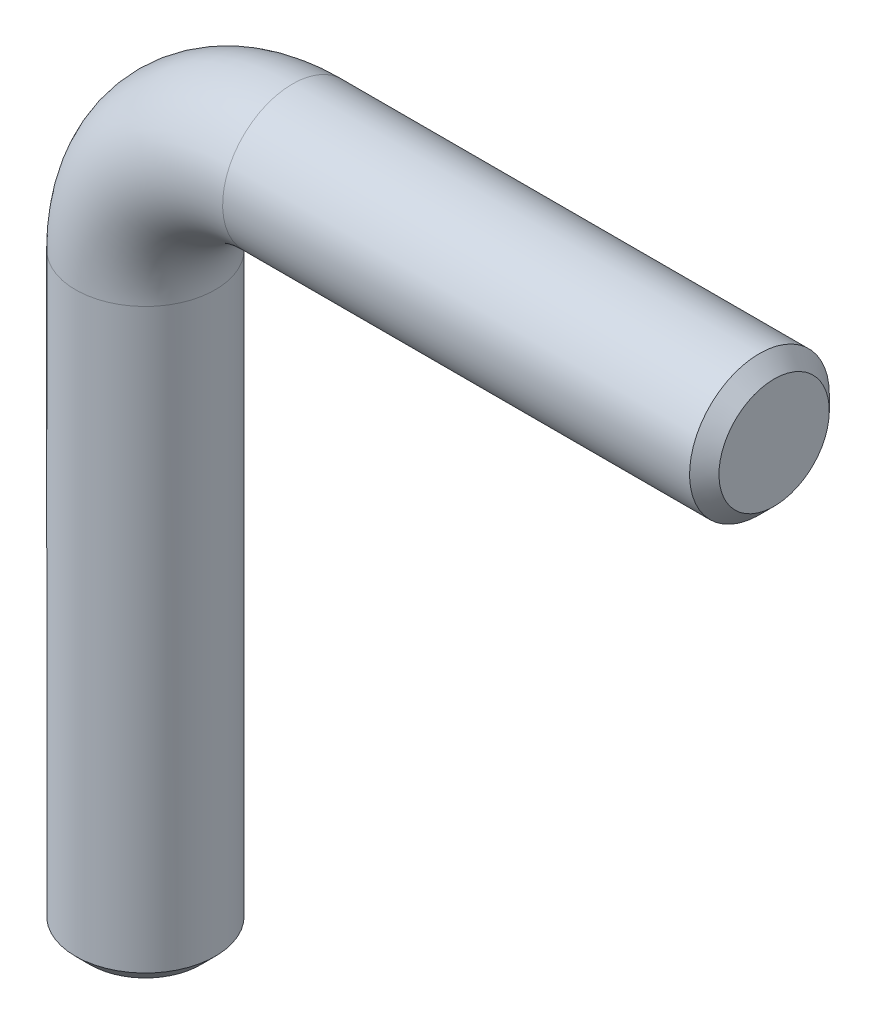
ISO-10303-21;
HEADER;
FILE_DESCRIPTION(('STEP AP214'),'2;1');
FILE_NAME('part.step','',(''),(''),'','','');
FILE_SCHEMA(('AUTOMOTIVE_DESIGN { 1 0 10303 214 1 1 1 1 }'));
ENDSEC;
DATA;
#1=APPLICATION_CONTEXT('core data for automotive mechanical design processes');
#2=APPLICATION_PROTOCOL_DEFINITION('international standard','automotive_design',2000,#1);
#3=PRODUCT_CONTEXT('',#1,'mechanical');
#4=PRODUCT('Part','Part','',(#3));
#5=PRODUCT_RELATED_PRODUCT_CATEGORY('part','',(#4));
#6=PRODUCT_DEFINITION_FORMATION('','',#4);
#7=PRODUCT_DEFINITION_CONTEXT('part definition',#1,'design');
#8=PRODUCT_DEFINITION('design','',#6,#7);
#9=PRODUCT_DEFINITION_SHAPE('','',#8);
#10=(LENGTH_UNIT() NAMED_UNIT(*) SI_UNIT(.MILLI.,.METRE.));
#11=(NAMED_UNIT(*) PLANE_ANGLE_UNIT() SI_UNIT($,.RADIAN.));
#12=(NAMED_UNIT(*) SI_UNIT($,.STERADIAN.) SOLID_ANGLE_UNIT());
#13=UNCERTAINTY_MEASURE_WITH_UNIT(LENGTH_MEASURE(1.E-05),#10,'distance_accuracy_value','');
#14=(GEOMETRIC_REPRESENTATION_CONTEXT(3) GLOBAL_UNCERTAINTY_ASSIGNED_CONTEXT((#13)) GLOBAL_UNIT_ASSIGNED_CONTEXT((#10,
#11,#12)) REPRESENTATION_CONTEXT('',''));
#15=CARTESIAN_POINT('',(0.,0.,0.));
#16=DIRECTION('',(0.,0.,1.));
#17=DIRECTION('',(1.,0.,0.));
#18=AXIS2_PLACEMENT_3D('',#15,#16,#17);
#19=CARTESIAN_POINT('',(10.,50.25,0.));
#20=DIRECTION('',(1.,0.,0.));
#21=DIRECTION('',(0.,0.,-1.));
#22=AXIS2_PLACEMENT_3D('',#19,#20,#21);
#23=CYLINDRICAL_SURFACE('',#22,4.75);
#24=CARTESIAN_POINT('',(41.75,50.25,0.));
#25=DIRECTION('',(1.,0.,0.));
#26=DIRECTION('',(0.,0.,-1.));
#27=AXIS2_PLACEMENT_3D('',#24,#25,#26);
#28=CIRCLE('',#27,4.75);
#29=CARTESIAN_POINT('',(41.75,50.25,-4.75));
#30=VERTEX_POINT('',#29);
#31=EDGE_CURVE('E10',#30,#30,#28,.F.);
#32=ORIENTED_EDGE('',*,*,#31,.T.);
#33=EDGE_LOOP('',(#32));
#34=FACE_BOUND('',#33,.T.);
#35=CARTESIAN_POINT('',(10.,50.25,0.));
#36=DIRECTION('',(1.,0.,0.));
#37=DIRECTION('',(0.,0.,1.));
#38=AXIS2_PLACEMENT_3D('',#35,#36,#37);
#39=CIRCLE('',#38,4.75);
#40=CARTESIAN_POINT('',(10.,55.,0.));
#41=VERTEX_POINT('',#40);
#42=EDGE_CURVE('E53',#41,#41,#39,.T.);
#43=ORIENTED_EDGE('',*,*,#42,.T.);
#44=EDGE_LOOP('',(#43));
#45=FACE_BOUND('',#44,.T.);
#46=ADVANCED_FACE('F33',(#34,#45),#23,.T.);
#47=CARTESIAN_POINT('',(10.,40.25,0.));
#48=DIRECTION('',(0.,0.,-1.));
#49=DIRECTION('',(-1.,0.,0.));
#50=AXIS2_PLACEMENT_3D('',#47,#48,#49);
#51=TOROIDAL_SURFACE('',#50,10.,4.75);
#52=CARTESIAN_POINT('',(0.,40.25,0.));
#53=DIRECTION('',(0.,1.,0.));
#54=DIRECTION('',(0.,0.,1.));
#55=AXIS2_PLACEMENT_3D('',#52,#53,#54);
#56=CIRCLE('',#55,4.75);
#57=CARTESIAN_POINT('',(-4.75,40.25,0.));
#58=VERTEX_POINT('',#57);
#59=EDGE_CURVE('E56',#58,#58,#56,.T.);
#60=CARTESIAN_POINT('',(10.,40.25,0.));
#61=DIRECTION('',(0.,0.,-1.));
#62=DIRECTION('',(-1.,0.,0.));
#63=AXIS2_PLACEMENT_3D('',#60,#61,#62);
#64=CIRCLE('',#63,14.75);
#65=EDGE_CURVE('',#58,#41,#64,.T.);
#66=ORIENTED_EDGE('',*,*,#59,.T.);
#67=ORIENTED_EDGE('',*,*,#42,.F.);
#68=ORIENTED_EDGE('',*,*,#65,.T.);
#69=ORIENTED_EDGE('',*,*,#65,.F.);
#70=EDGE_LOOP('',(#66,#68,#67,#69));
#71=FACE_BOUND('',#70,.T.);
#72=ADVANCED_FACE('F60',(#71),#51,.T.);
#73=CARTESIAN_POINT('',(0.,40.25,0.));
#74=DIRECTION('',(0.,-1.,0.));
#75=DIRECTION('',(0.,0.,-1.));
#76=AXIS2_PLACEMENT_3D('',#73,#74,#75);
#77=CYLINDRICAL_SURFACE('',#76,4.75);
#78=CARTESIAN_POINT('',(0.,1.00000000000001,0.));
#79=DIRECTION('',(0.,1.,0.));
#80=DIRECTION('',(0.,0.,1.));
#81=AXIS2_PLACEMENT_3D('',#78,#79,#80);
#82=CIRCLE('',#81,4.75);
#83=CARTESIAN_POINT('',(0.,1.00000000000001,4.75));
#84=VERTEX_POINT('',#83);
#85=EDGE_CURVE('E48',#84,#84,#82,.T.);
#86=ORIENTED_EDGE('',*,*,#85,.T.);
#87=EDGE_LOOP('',(#86));
#88=FACE_BOUND('',#87,.T.);
#89=ORIENTED_EDGE('',*,*,#59,.F.);
#90=EDGE_LOOP('',(#89));
#91=FACE_BOUND('',#90,.T.);
#92=ADVANCED_FACE('F63',(#88,#91),#77,.T.);
#93=CARTESIAN_POINT('',(42.75,50.25,0.));
#94=DIRECTION('',(1.,0.,0.));
#95=DIRECTION('',(0.,0.,1.));
#96=AXIS2_PLACEMENT_3D('',#93,#94,#95);
#97=PLANE('',#96);
#98=CARTESIAN_POINT('',(42.75,50.25,0.));
#99=DIRECTION('',(1.,0.,0.));
#100=DIRECTION('',(0.,1.,0.));
#101=AXIS2_PLACEMENT_3D('',#98,#99,#100);
#102=CIRCLE('',#101,3.75);
#103=CARTESIAN_POINT('',(42.75,54.,0.));
#104=VERTEX_POINT('',#103);
#105=EDGE_CURVE('E40',#104,#104,#102,.T.);
#106=ORIENTED_EDGE('',*,*,#105,.T.);
#107=EDGE_LOOP('',(#106));
#108=FACE_BOUND('',#107,.T.);
#109=ADVANCED_FACE('F65',(#108),#97,.T.);
#110=CARTESIAN_POINT('',(0.,0.,0.));
#111=DIRECTION('',(0.,1.,0.));
#112=DIRECTION('',(0.,0.,1.));
#113=AXIS2_PLACEMENT_3D('',#110,#111,#112);
#114=PLANE('',#113);
#115=CARTESIAN_POINT('',(0.,0.,0.));
#116=DIRECTION('',(0.,1.,0.));
#117=DIRECTION('',(0.,0.,1.));
#118=AXIS2_PLACEMENT_3D('',#115,#116,#117);
#119=CIRCLE('',#118,3.74999999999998);
#120=CARTESIAN_POINT('',(0.,0.,3.74999999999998));
#121=VERTEX_POINT('',#120);
#122=EDGE_CURVE('E44',#121,#121,#119,.F.);
#123=ORIENTED_EDGE('',*,*,#122,.T.);
#124=EDGE_LOOP('',(#123));
#125=FACE_BOUND('',#124,.T.);
#126=ADVANCED_FACE('F72',(#125),#114,.F.);
#127=CARTESIAN_POINT('',(0.,1.00000000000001,0.));
#128=DIRECTION('',(0.,1.,0.));
#129=DIRECTION('',(0.,0.,1.));
#130=AXIS2_PLACEMENT_3D('',#127,#128,#129);
#131=CONICAL_SURFACE('',#130,4.75,0.78539816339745);
#132=ORIENTED_EDGE('',*,*,#122,.F.);
#133=EDGE_LOOP('',(#132));
#134=FACE_BOUND('',#133,.T.);
#135=ORIENTED_EDGE('',*,*,#85,.F.);
#136=EDGE_LOOP('',(#135));
#137=FACE_BOUND('',#136,.T.);
#138=ADVANCED_FACE('F81',(#134,#137),#131,.T.);
#139=CARTESIAN_POINT('',(42.75,50.25,0.));
#140=DIRECTION('',(-1.,0.,0.));
#141=DIRECTION('',(0.,0.,1.));
#142=AXIS2_PLACEMENT_3D('',#139,#140,#141);
#143=CONICAL_SURFACE('',#142,3.75,0.785398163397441);
#144=ORIENTED_EDGE('',*,*,#31,.F.);
#145=EDGE_LOOP('',(#144));
#146=FACE_BOUND('',#145,.T.);
#147=ORIENTED_EDGE('',*,*,#105,.F.);
#148=EDGE_LOOP('',(#147));
#149=FACE_BOUND('',#148,.T.);
#150=ADVANCED_FACE('F35',(#146,#149),#143,.T.);
#151=CLOSED_SHELL('',(#46,#72,#92,#109,#126,#138,#150));
#152=MANIFOLD_SOLID_BREP('B2',#151);
#153=ADVANCED_BREP_SHAPE_REPRESENTATION('',(#18,#152),#14);
#154=SHAPE_DEFINITION_REPRESENTATION(#9,#153);
ENDSEC;
END-ISO-10303-21;
